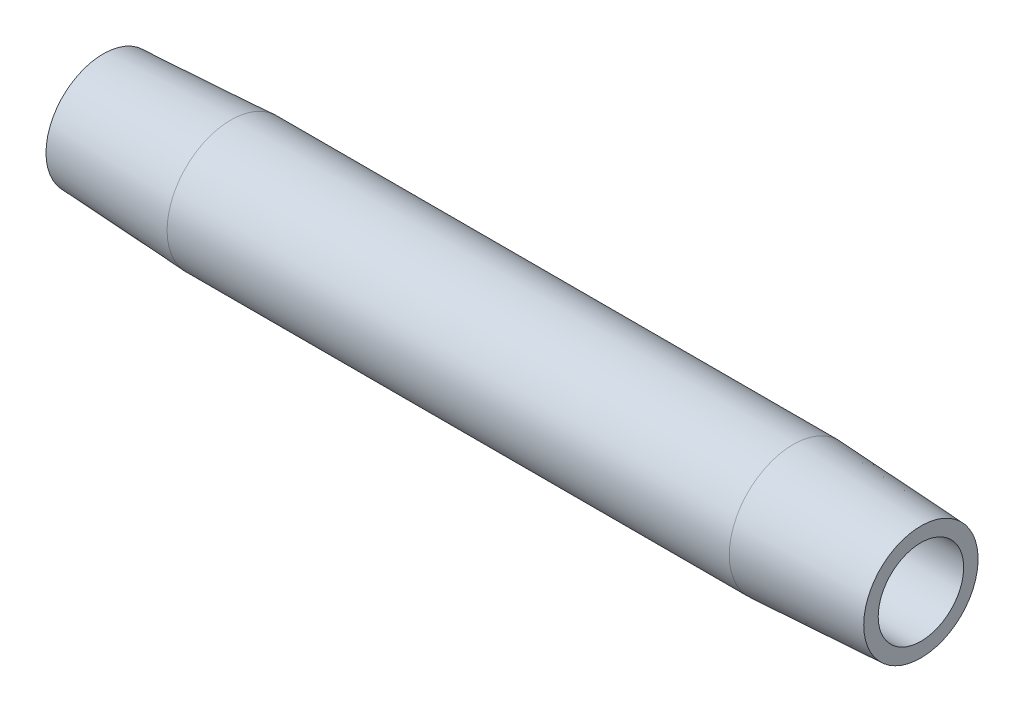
ISO-10303-21;
HEADER;
FILE_DESCRIPTION(('STEP AP214'),'2;1');
FILE_NAME('part.step','',(''),(''),'','','');
FILE_SCHEMA(('AUTOMOTIVE_DESIGN { 1 0 10303 214 1 1 1 1 }'));
ENDSEC;
DATA;
#1=APPLICATION_CONTEXT('core data for automotive mechanical design processes');
#2=APPLICATION_PROTOCOL_DEFINITION('international standard','automotive_design',2000,#1);
#3=PRODUCT_CONTEXT('',#1,'mechanical');
#4=PRODUCT('Part','Part','',(#3));
#5=PRODUCT_RELATED_PRODUCT_CATEGORY('part','',(#4));
#6=PRODUCT_DEFINITION_FORMATION('','',#4);
#7=PRODUCT_DEFINITION_CONTEXT('part definition',#1,'design');
#8=PRODUCT_DEFINITION('design','',#6,#7);
#9=PRODUCT_DEFINITION_SHAPE('','',#8);
#10=(LENGTH_UNIT() NAMED_UNIT(*) SI_UNIT(.MILLI.,.METRE.));
#11=(NAMED_UNIT(*) PLANE_ANGLE_UNIT() SI_UNIT($,.RADIAN.));
#12=(NAMED_UNIT(*) SI_UNIT($,.STERADIAN.) SOLID_ANGLE_UNIT());
#13=UNCERTAINTY_MEASURE_WITH_UNIT(LENGTH_MEASURE(1.E-05),#10,'distance_accuracy_value','');
#14=(GEOMETRIC_REPRESENTATION_CONTEXT(3) GLOBAL_UNCERTAINTY_ASSIGNED_CONTEXT((#13)) GLOBAL_UNIT_ASSIGNED_CONTEXT((#10,
#11,#12)) REPRESENTATION_CONTEXT('',''));
#15=CARTESIAN_POINT('',(0.,0.,0.));
#16=DIRECTION('',(0.,0.,1.));
#17=DIRECTION('',(1.,0.,0.));
#18=AXIS2_PLACEMENT_3D('',#15,#16,#17);
#19=CARTESIAN_POINT('',(0.476141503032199,0.,0.));
#20=DIRECTION('',(-1.,0.,0.));
#21=DIRECTION('',(0.,0.,1.));
#22=AXIS2_PLACEMENT_3D('',#19,#20,#21);
#23=CYLINDRICAL_SURFACE('',#22,3.96875);
#24=CARTESIAN_POINT('',(7.9375,0.,0.));
#25=DIRECTION('',(-1.,0.,0.));
#26=DIRECTION('',(0.,0.,1.));
#27=AXIS2_PLACEMENT_3D('',#24,#25,#26);
#28=CIRCLE('',#27,3.96875);
#29=CARTESIAN_POINT('',(7.9375,0.,3.96875));
#30=VERTEX_POINT('',#29);
#31=EDGE_CURVE('E10',#30,#30,#28,.T.);
#32=ORIENTED_EDGE('',*,*,#31,.F.);
#33=EDGE_LOOP('',(#32));
#34=FACE_BOUND('',#33,.T.);
#35=CARTESIAN_POINT('',(42.8625,0.,0.));
#36=DIRECTION('',(-1.,0.,0.));
#37=DIRECTION('',(0.,0.,1.));
#38=AXIS2_PLACEMENT_3D('',#35,#36,#37);
#39=CIRCLE('',#38,3.96875);
#40=CARTESIAN_POINT('',(42.8625,0.,3.96875));
#41=VERTEX_POINT('',#40);
#42=EDGE_CURVE('E52',#41,#41,#39,.T.);
#43=ORIENTED_EDGE('',*,*,#42,.T.);
#44=EDGE_LOOP('',(#43));
#45=FACE_BOUND('',#44,.T.);
#46=ADVANCED_FACE('F30',(#34,#45),#23,.T.);
#47=CARTESIAN_POINT('',(7.9375,0.,0.));
#48=DIRECTION('',(1.,0.,0.));
#49=DIRECTION('',(0.,0.,-1.));
#50=AXIS2_PLACEMENT_3D('',#47,#48,#49);
#51=CONICAL_SURFACE('',#50,3.96875,0.0523598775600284);
#52=CARTESIAN_POINT('',(0.,0.,0.));
#53=DIRECTION('',(-1.,0.,0.));
#54=DIRECTION('',(0.,0.,1.));
#55=AXIS2_PLACEMENT_3D('',#52,#53,#54);
#56=CIRCLE('',#55,3.55276325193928);
#57=CARTESIAN_POINT('',(0.,0.,3.55276325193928));
#58=VERTEX_POINT('',#57);
#59=EDGE_CURVE('E36',#58,#58,#56,.T.);
#60=ORIENTED_EDGE('',*,*,#59,.F.);
#61=EDGE_LOOP('',(#60));
#62=FACE_BOUND('',#61,.T.);
#63=ORIENTED_EDGE('',*,*,#31,.T.);
#64=EDGE_LOOP('',(#63));
#65=FACE_BOUND('',#64,.T.);
#66=ADVANCED_FACE('F77',(#62,#65),#51,.T.);
#67=CARTESIAN_POINT('',(0.,3.55276325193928,0.));
#68=DIRECTION('',(1.,0.,0.));
#69=DIRECTION('',(0.,0.,-1.));
#70=AXIS2_PLACEMENT_3D('',#67,#68,#69);
#71=PLANE('',#70);
#72=CARTESIAN_POINT('',(0.,0.,0.));
#73=DIRECTION('',(-1.,0.,0.));
#74=DIRECTION('',(0.,0.,1.));
#75=AXIS2_PLACEMENT_3D('',#72,#73,#74);
#76=CIRCLE('',#75,2.65429999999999);
#77=CARTESIAN_POINT('',(0.,0.,2.65429999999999));
#78=VERTEX_POINT('',#77);
#79=EDGE_CURVE('E40',#78,#78,#76,.T.);
#80=ORIENTED_EDGE('',*,*,#79,.F.);
#81=EDGE_LOOP('',(#80));
#82=FACE_BOUND('',#81,.T.);
#83=ORIENTED_EDGE('',*,*,#59,.T.);
#84=EDGE_LOOP('',(#83));
#85=FACE_BOUND('',#84,.T.);
#86=ADVANCED_FACE('F72',(#82,#85),#71,.F.);
#87=CARTESIAN_POINT('',(0.476141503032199,0.,0.));
#88=DIRECTION('',(-1.,0.,0.));
#89=DIRECTION('',(0.,0.,1.));
#90=AXIS2_PLACEMENT_3D('',#87,#88,#89);
#91=CYLINDRICAL_SURFACE('',#90,2.6543);
#92=CARTESIAN_POINT('',(50.8,0.,0.));
#93=DIRECTION('',(-1.,0.,0.));
#94=DIRECTION('',(0.,0.,1.));
#95=AXIS2_PLACEMENT_3D('',#92,#93,#94);
#96=CIRCLE('',#95,2.6543);
#97=CARTESIAN_POINT('',(50.8,0.,2.6543));
#98=VERTEX_POINT('',#97);
#99=EDGE_CURVE('E44',#98,#98,#96,.T.);
#100=ORIENTED_EDGE('',*,*,#99,.F.);
#101=EDGE_LOOP('',(#100));
#102=FACE_BOUND('',#101,.T.);
#103=ORIENTED_EDGE('',*,*,#79,.T.);
#104=EDGE_LOOP('',(#103));
#105=FACE_BOUND('',#104,.T.);
#106=ADVANCED_FACE('F66',(#102,#105),#91,.F.);
#107=CARTESIAN_POINT('',(50.8,2.6543,0.));
#108=DIRECTION('',(-1.,0.,0.));
#109=DIRECTION('',(0.,0.,1.));
#110=AXIS2_PLACEMENT_3D('',#107,#108,#109);
#111=PLANE('',#110);
#112=CARTESIAN_POINT('',(50.8,0.,0.));
#113=DIRECTION('',(-1.,0.,0.));
#114=DIRECTION('',(0.,0.,1.));
#115=AXIS2_PLACEMENT_3D('',#112,#113,#114);
#116=CIRCLE('',#115,3.55276325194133);
#117=CARTESIAN_POINT('',(50.8,0.,3.55276325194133));
#118=VERTEX_POINT('',#117);
#119=EDGE_CURVE('E49',#118,#118,#116,.T.);
#120=ORIENTED_EDGE('',*,*,#119,.F.);
#121=EDGE_LOOP('',(#120));
#122=FACE_BOUND('',#121,.T.);
#123=ORIENTED_EDGE('',*,*,#99,.T.);
#124=EDGE_LOOP('',(#123));
#125=FACE_BOUND('',#124,.T.);
#126=ADVANCED_FACE('F60',(#122,#125),#111,.F.);
#127=CARTESIAN_POINT('',(50.8,0.,0.));
#128=DIRECTION('',(-1.,0.,0.));
#129=DIRECTION('',(0.,0.,1.));
#130=AXIS2_PLACEMENT_3D('',#127,#128,#129);
#131=CONICAL_SURFACE('',#130,3.55276325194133,0.0523598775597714);
#132=ORIENTED_EDGE('',*,*,#42,.F.);
#133=EDGE_LOOP('',(#132));
#134=FACE_BOUND('',#133,.T.);
#135=ORIENTED_EDGE('',*,*,#119,.T.);
#136=EDGE_LOOP('',(#135));
#137=FACE_BOUND('',#136,.T.);
#138=ADVANCED_FACE('F57',(#134,#137),#131,.T.);
#139=CLOSED_SHELL('',(#46,#66,#86,#106,#126,#138));
#140=MANIFOLD_SOLID_BREP('B2',#139);
#141=ADVANCED_BREP_SHAPE_REPRESENTATION('',(#18,#140),#14);
#142=SHAPE_DEFINITION_REPRESENTATION(#9,#141);
ENDSEC;
END-ISO-10303-21;
